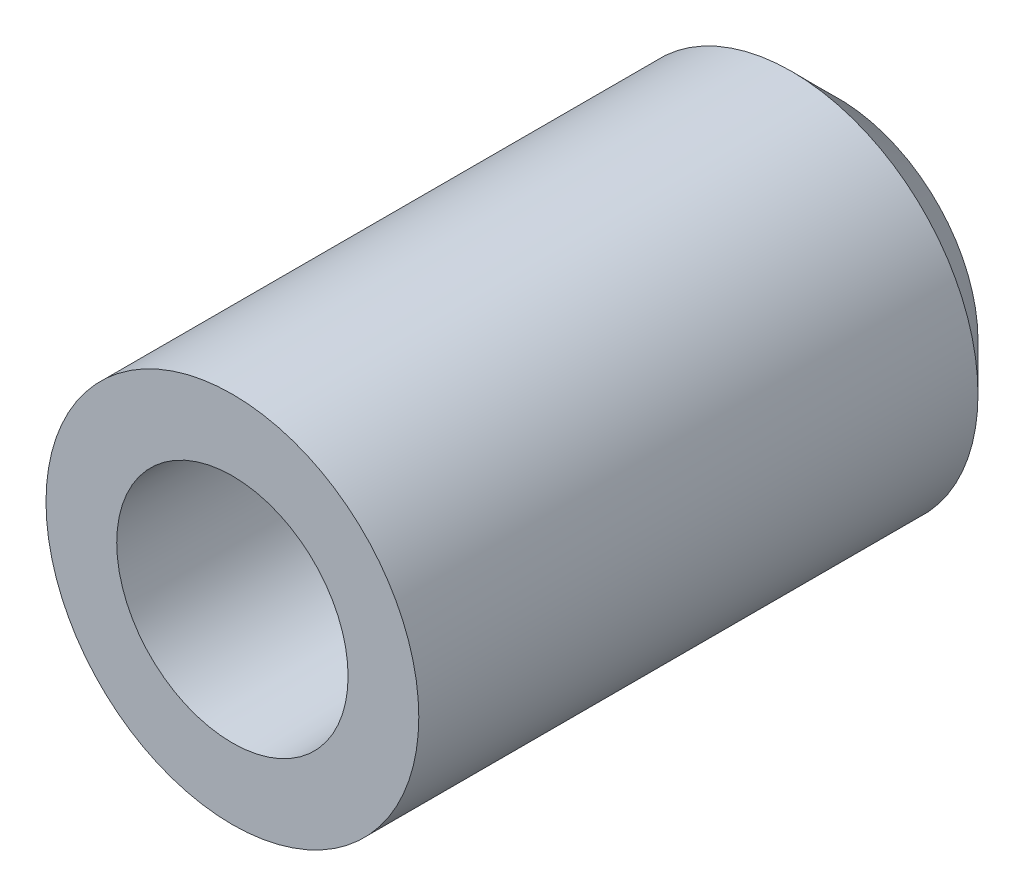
ISO-10303-21;
HEADER;
FILE_DESCRIPTION(('STEP AP214'),'2;1');
FILE_NAME('part.step','',(''),(''),'','','');
FILE_SCHEMA(('AUTOMOTIVE_DESIGN { 1 0 10303 214 1 1 1 1 }'));
ENDSEC;
DATA;
#1=APPLICATION_CONTEXT('core data for automotive mechanical design processes');
#2=APPLICATION_PROTOCOL_DEFINITION('international standard','automotive_design',2000,#1);
#3=PRODUCT_CONTEXT('',#1,'mechanical');
#4=PRODUCT('Part','Part','',(#3));
#5=PRODUCT_RELATED_PRODUCT_CATEGORY('part','',(#4));
#6=PRODUCT_DEFINITION_FORMATION('','',#4);
#7=PRODUCT_DEFINITION_CONTEXT('part definition',#1,'design');
#8=PRODUCT_DEFINITION('design','',#6,#7);
#9=PRODUCT_DEFINITION_SHAPE('','',#8);
#10=(LENGTH_UNIT() NAMED_UNIT(*) SI_UNIT(.MILLI.,.METRE.));
#11=(NAMED_UNIT(*) PLANE_ANGLE_UNIT() SI_UNIT($,.RADIAN.));
#12=(NAMED_UNIT(*) SI_UNIT($,.STERADIAN.) SOLID_ANGLE_UNIT());
#13=UNCERTAINTY_MEASURE_WITH_UNIT(LENGTH_MEASURE(1.E-05),#10,'distance_accuracy_value','');
#14=(GEOMETRIC_REPRESENTATION_CONTEXT(3) GLOBAL_UNCERTAINTY_ASSIGNED_CONTEXT((#13)) GLOBAL_UNIT_ASSIGNED_CONTEXT((#10,
#11,#12)) REPRESENTATION_CONTEXT('',''));
#15=CARTESIAN_POINT('',(0.,0.,0.));
#16=DIRECTION('',(0.,0.,1.));
#17=DIRECTION('',(1.,0.,0.));
#18=AXIS2_PLACEMENT_3D('',#15,#16,#17);
#19=CARTESIAN_POINT('',(0.,0.,-7.00784684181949));
#20=DIRECTION('',(0.,0.,1.));
#21=DIRECTION('',(1.,0.,0.));
#22=AXIS2_PLACEMENT_3D('',#19,#20,#21);
#23=CONICAL_SURFACE('',#22,3.38742276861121,0.785398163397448);
#24=CARTESIAN_POINT('',(0.,0.,-9.14526961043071));
#25=DIRECTION('',(0.,0.,1.));
#26=DIRECTION('',(1.,0.,0.));
#27=AXIS2_PLACEMENT_3D('',#24,#25,#26);
#28=CIRCLE('',#27,1.24999999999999);
#29=CARTESIAN_POINT('',(1.24999999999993,0.,-9.14526961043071));
#30=VERTEX_POINT('',#29);
#31=EDGE_CURVE('E97',#30,#30,#28,.F.);
#32=ORIENTED_EDGE('',*,*,#31,.T.);
#33=EDGE_LOOP('',(#32));
#34=FACE_BOUND('',#33,.T.);
#35=CARTESIAN_POINT('',(1.5000010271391,0.,-8.89526858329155));
#36=CARTESIAN_POINT('',(2.39526828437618,0.,-8.00000132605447));
#37=B_SPLINE_CURVE_WITH_KNOTS('',1,(#35,#36),.UNSPECIFIED.,.F.,.F.,(2,2),(0.44281482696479,
0.707106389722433),.UNSPECIFIED.);
#38=CARTESIAN_POINT('',(1.49999999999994,0.,-8.89526961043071));
#39=VERTEX_POINT('',#38);
#40=CARTESIAN_POINT('',(2.39526961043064,0.,-8.));
#41=VERTEX_POINT('',#40);
#42=EDGE_CURVE('E44',#39,#41,#37,.T.);
#43=ORIENTED_EDGE('',*,*,#42,.F.);
#44=ORIENTED_EDGE('',*,*,#42,.T.);
#45=CARTESIAN_POINT('',(0.,0.,-8.));
#46=DIRECTION('',(0.,0.,-1.));
#47=DIRECTION('',(-1.,0.,0.));
#48=AXIS2_PLACEMENT_3D('',#45,#46,#47);
#49=CIRCLE('',#48,2.39526961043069);
#50=CARTESIAN_POINT('',(-2.39526961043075,0.,-8.));
#51=VERTEX_POINT('',#50);
#52=EDGE_CURVE('E11',#51,#41,#49,.T.);
#53=ORIENTED_EDGE('',*,*,#52,.F.);
#54=CARTESIAN_POINT('',(0.,0.,-8.));
#55=DIRECTION('',(0.,0.,-1.));
#56=DIRECTION('',(-1.,0.,0.));
#57=AXIS2_PLACEMENT_3D('',#54,#55,#56);
#58=CIRCLE('',#57,2.39526961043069);
#59=EDGE_CURVE('E55',#41,#51,#58,.T.);
#60=ORIENTED_EDGE('',*,*,#59,.F.);
#61=EDGE_LOOP('',(#43,#44,#53,#60));
#62=FACE_BOUND('',#61,.T.);
#63=ADVANCED_FACE('F36',(#34,#62),#23,.F.);
#64=CARTESIAN_POINT('',(0.,0.,-7.5));
#65=DIRECTION('',(0.,0.,-1.));
#66=DIRECTION('',(-1.,0.,0.));
#67=AXIS2_PLACEMENT_3D('',#64,#65,#66);
#68=CYLINDRICAL_SURFACE('',#67,2.39526961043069);
#69=CARTESIAN_POINT('',(0.,0.,-6.));
#70=DIRECTION('',(0.,0.,-1.));
#71=DIRECTION('',(-1.,0.,0.));
#72=AXIS2_PLACEMENT_3D('',#69,#70,#71);
#73=CIRCLE('',#72,2.39526961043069);
#74=CARTESIAN_POINT('',(-2.39526961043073,0.,-6.));
#75=VERTEX_POINT('',#74);
#76=EDGE_CURVE('E145',#75,#75,#73,.T.);
#77=ORIENTED_EDGE('',*,*,#76,.F.);
#78=CARTESIAN_POINT('',(-2.39526961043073,0.,-5.99999694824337));
#79=CARTESIAN_POINT('',(-2.39526961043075,0.,-8.00000201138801));
#80=B_SPLINE_CURVE_WITH_KNOTS('',1,(#78,#79),.UNSPECIFIED.,.F.,.F.,(2,2),(0.0833320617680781,
0.91666750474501),.UNSPECIFIED.);
#81=EDGE_CURVE('E140',#75,#51,#80,.T.);
#82=ORIENTED_EDGE('',*,*,#81,.T.);
#83=ORIENTED_EDGE('',*,*,#52,.T.);
#84=ORIENTED_EDGE('',*,*,#59,.T.);
#85=ORIENTED_EDGE('',*,*,#81,.F.);
#86=EDGE_LOOP('',(#77,#82,#83,#84,#85));
#87=FACE_BOUND('',#86,.T.);
#88=ADVANCED_FACE('F177',(#87),#68,.F.);
#89=CARTESIAN_POINT('',(0.,0.,-1.));
#90=DIRECTION('',(0.,0.,1.));
#91=DIRECTION('',(-1.,0.,0.));
#92=AXIS2_PLACEMENT_3D('',#89,#90,#91);
#93=CONICAL_SURFACE('',#92,2.48254493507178,0.0174532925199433);
#94=ORIENTED_EDGE('',*,*,#76,.T.);
#95=CARTESIAN_POINT('',(-2.39526961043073,0.,-6.));
#96=CARTESIAN_POINT('',(-2.48254493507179,0.,-0.999999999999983));
#97=B_SPLINE_CURVE_WITH_KNOTS('',1,(#95,#96),.UNSPECIFIED.,.F.,.F.,(2,2),(0.,1.),.UNSPECIFIED.);
#98=CARTESIAN_POINT('',(-2.48254493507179,0.,-0.999999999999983));
#99=VERTEX_POINT('',#98);
#100=EDGE_CURVE('E102',#75,#99,#97,.T.);
#101=ORIENTED_EDGE('',*,*,#100,.T.);
#102=CARTESIAN_POINT('',(0.,0.,-1.));
#103=DIRECTION('',(0.,0.,-1.));
#104=DIRECTION('',(1.,0.,0.));
#105=AXIS2_PLACEMENT_3D('',#102,#103,#104);
#106=CIRCLE('',#105,2.48254493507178);
#107=CARTESIAN_POINT('',(2.48254493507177,0.,-1.00000000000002));
#108=VERTEX_POINT('',#107);
#109=EDGE_CURVE('E127',#108,#99,#106,.T.);
#110=ORIENTED_EDGE('',*,*,#109,.F.);
#111=CARTESIAN_POINT('',(0.,0.,-1.));
#112=DIRECTION('',(0.,0.,-1.));
#113=DIRECTION('',(1.,0.,0.));
#114=AXIS2_PLACEMENT_3D('',#111,#112,#113);
#115=CIRCLE('',#114,2.48254493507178);
#116=EDGE_CURVE('E120',#99,#108,#115,.T.);
#117=ORIENTED_EDGE('',*,*,#116,.F.);
#118=ORIENTED_EDGE('',*,*,#100,.F.);
#119=EDGE_LOOP('',(#94,#101,#110,#117,#118));
#120=FACE_BOUND('',#119,.T.);
#121=ADVANCED_FACE('F175',(#120),#93,.F.);
#122=CARTESIAN_POINT('',(0.,0.,-11.3431457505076));
#123=DIRECTION('',(0.,0.,1.));
#124=DIRECTION('',(1.,0.,0.));
#125=AXIS2_PLACEMENT_3D('',#122,#123,#124);
#126=CONICAL_SURFACE('',#125,5.65685424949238,0.785398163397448);
#127=CARTESIAN_POINT('',(0.,0.,-14.));
#128=DIRECTION('',(0.,0.,1.));
#129=DIRECTION('',(-1.,0.,0.));
#130=AXIS2_PLACEMENT_3D('',#127,#128,#129);
#131=CIRCLE('',#130,3.);
#132=CARTESIAN_POINT('',(-3.0000000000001,0.,-14.));
#133=VERTEX_POINT('',#132);
#134=CARTESIAN_POINT('',(2.9999999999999,0.,-14.));
#135=VERTEX_POINT('',#134);
#136=EDGE_CURVE('E84',#133,#135,#131,.T.);
#137=ORIENTED_EDGE('',*,*,#136,.T.);
#138=CARTESIAN_POINT('',(2.99999707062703,0.,-14.0000029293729));
#139=CARTESIAN_POINT('',(3.99999755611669,0.,-13.0000024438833));
#140=B_SPLINE_CURVE_WITH_KNOTS('',1,(#138,#139),.UNSPECIFIED.,.F.,.F.,(2,2),(0.530329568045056,
0.707106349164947),.UNSPECIFIED.);
#141=CARTESIAN_POINT('',(3.99999999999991,0.,-13.));
#142=VERTEX_POINT('',#141);
#143=EDGE_CURVE('E89',#135,#142,#140,.T.);
#144=ORIENTED_EDGE('',*,*,#143,.T.);
#145=CARTESIAN_POINT('',(0.,0.,-13.));
#146=DIRECTION('',(0.,0.,-1.));
#147=DIRECTION('',(-1.,0.,0.));
#148=AXIS2_PLACEMENT_3D('',#145,#146,#147);
#149=CIRCLE('',#148,4.);
#150=CARTESIAN_POINT('',(-4.00000000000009,0.,-13.));
#151=VERTEX_POINT('',#150);
#152=EDGE_CURVE('E96',#142,#151,#149,.T.);
#153=ORIENTED_EDGE('',*,*,#152,.T.);
#154=CARTESIAN_POINT('',(0.,0.,-13.));
#155=DIRECTION('',(0.,0.,-1.));
#156=DIRECTION('',(-1.,0.,0.));
#157=AXIS2_PLACEMENT_3D('',#154,#155,#156);
#158=CIRCLE('',#157,4.);
#159=EDGE_CURVE('E99',#151,#142,#158,.T.);
#160=ORIENTED_EDGE('',*,*,#159,.T.);
#161=ORIENTED_EDGE('',*,*,#143,.F.);
#162=CARTESIAN_POINT('',(0.,0.,-14.));
#163=DIRECTION('',(0.,0.,1.));
#164=DIRECTION('',(-1.,0.,0.));
#165=AXIS2_PLACEMENT_3D('',#162,#163,#164);
#166=CIRCLE('',#165,3.);
#167=EDGE_CURVE('E91',#135,#133,#166,.T.);
#168=ORIENTED_EDGE('',*,*,#167,.T.);
#169=EDGE_LOOP('',(#137,#144,#153,#160,#161,#168));
#170=FACE_BOUND('',#169,.T.);
#171=ADVANCED_FACE('F86',(#170),#126,.T.);
#172=CARTESIAN_POINT('',(0.,0.,-7.5));
#173=DIRECTION('',(0.,0.,-1.));
#174=DIRECTION('',(-1.,0.,0.));
#175=AXIS2_PLACEMENT_3D('',#172,#173,#174);
#176=CYLINDRICAL_SURFACE('',#175,4.);
#177=CARTESIAN_POINT('',(0.,0.,-1.));
#178=DIRECTION('',(0.,0.,1.));
#179=DIRECTION('',(-1.,0.,0.));
#180=AXIS2_PLACEMENT_3D('',#177,#178,#179);
#181=CIRCLE('',#180,4.);
#182=CARTESIAN_POINT('',(-4.,0.,-0.999999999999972));
#183=VERTEX_POINT('',#182);
#184=EDGE_CURVE('E93',#183,#183,#181,.T.);
#185=ORIENTED_EDGE('',*,*,#184,.F.);
#186=CARTESIAN_POINT('',(-4.,0.,-1.00000091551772));
#187=CARTESIAN_POINT('',(-4.00000000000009,0.,-13.0000012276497));
#188=B_SPLINE_CURVE_WITH_KNOTS('',1,(#186,#187),.UNSPECIFIED.,.F.,.F.,(2,2),(0.0833333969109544,
0.916666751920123),.UNSPECIFIED.);
#189=EDGE_CURVE('E162',#183,#151,#188,.T.);
#190=ORIENTED_EDGE('',*,*,#189,.T.);
#191=ORIENTED_EDGE('',*,*,#152,.F.);
#192=ORIENTED_EDGE('',*,*,#159,.F.);
#193=ORIENTED_EDGE('',*,*,#189,.F.);
#194=EDGE_LOOP('',(#185,#190,#191,#192,#193));
#195=FACE_BOUND('',#194,.T.);
#196=ADVANCED_FACE('F193',(#195),#176,.T.);
#197=CARTESIAN_POINT('',(6.8999999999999,-6.23538290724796,-14.));
#198=DIRECTION('',(0.,0.,-1.));
#199=DIRECTION('',(-1.,0.,0.));
#200=AXIS2_PLACEMENT_3D('',#197,#198,#199);
#201=PLANE('',#200);
#202=CARTESIAN_POINT('',(0.,0.,-14.));
#203=DIRECTION('',(0.,0.,-1.));
#204=DIRECTION('',(-1.,0.,0.));
#205=AXIS2_PLACEMENT_3D('',#202,#203,#204);
#206=CIRCLE('',#205,1.24999999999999);
#207=CARTESIAN_POINT('',(-1.25000000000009,0.,-14.));
#208=VERTEX_POINT('',#207);
#209=EDGE_CURVE('E186',#208,#208,#206,.T.);
#210=ORIENTED_EDGE('',*,*,#209,.F.);
#211=EDGE_LOOP('',(#210));
#212=FACE_BOUND('',#211,.T.);
#213=ORIENTED_EDGE('',*,*,#167,.F.);
#214=ORIENTED_EDGE('',*,*,#136,.F.);
#215=EDGE_LOOP('',(#213,#214));
#216=FACE_BOUND('',#215,.T.);
#217=ADVANCED_FACE('F95',(#212,#216),#201,.T.);
#218=CARTESIAN_POINT('',(-5.2,-8.31384387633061,-0.999999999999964));
#219=DIRECTION('',(0.,0.,1.));
#220=DIRECTION('',(1.,0.,0.));
#221=AXIS2_PLACEMENT_3D('',#218,#219,#220);
#222=PLANE('',#221);
#223=ORIENTED_EDGE('',*,*,#184,.T.);
#224=EDGE_LOOP('',(#223));
#225=FACE_BOUND('',#224,.T.);
#226=ORIENTED_EDGE('',*,*,#109,.T.);
#227=ORIENTED_EDGE('',*,*,#116,.T.);
#228=EDGE_LOOP('',(#226,#227));
#229=FACE_BOUND('',#228,.T.);
#230=ADVANCED_FACE('F195',(#225,#229),#222,.T.);
#231=CARTESIAN_POINT('',(0.,0.,-14.));
#232=DIRECTION('',(0.,0.,-1.));
#233=DIRECTION('',(-1.,0.,0.));
#234=AXIS2_PLACEMENT_3D('',#231,#232,#233);
#235=CYLINDRICAL_SURFACE('',#234,1.24999999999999);
#236=ORIENTED_EDGE('',*,*,#209,.T.);
#237=EDGE_LOOP('',(#236));
#238=FACE_BOUND('',#237,.T.);
#239=ORIENTED_EDGE('',*,*,#31,.F.);
#240=EDGE_LOOP('',(#239));
#241=FACE_BOUND('',#240,.T.);
#242=ADVANCED_FACE('F198',(#238,#241),#235,.F.);
#243=CLOSED_SHELL('',(#63,#88,#121,#171,#196,#217,#230,#242));
#244=MANIFOLD_SOLID_BREP('B2',#243);
#245=ADVANCED_BREP_SHAPE_REPRESENTATION('',(#18,#244),#14);
#246=SHAPE_DEFINITION_REPRESENTATION(#9,#245);
ENDSEC;
END-ISO-10303-21;
